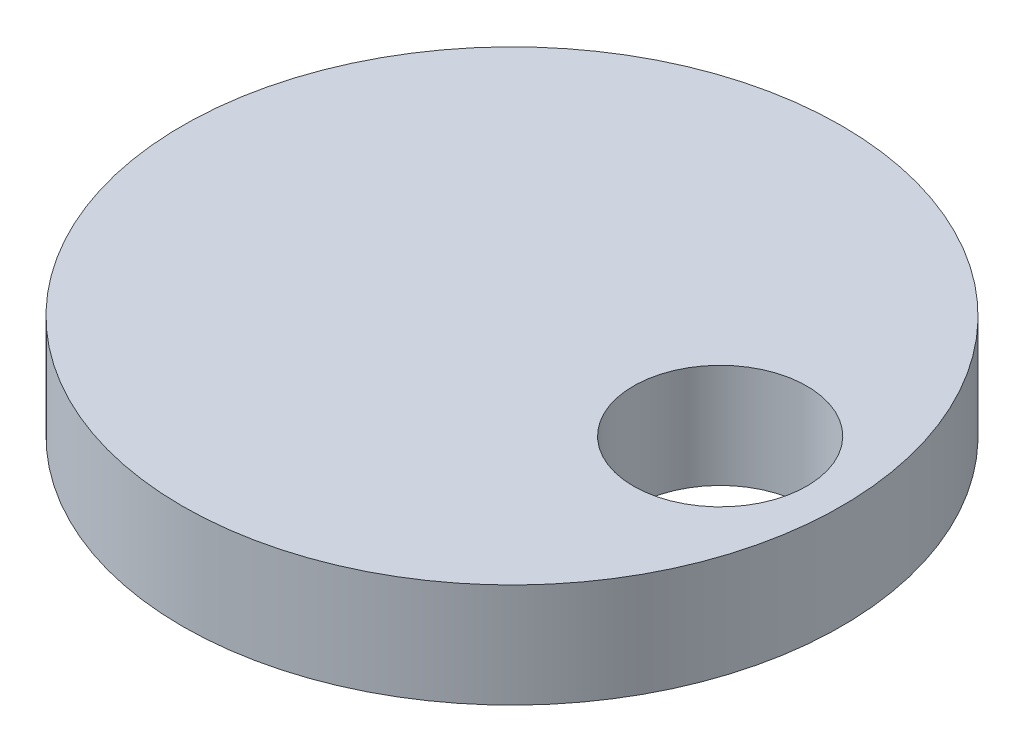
from build123d import *

# Parameters (mm, degrees)
SKETCH1_R         = 9.5
EXTRUDE1_DEPTH    = 3
M6_TAPPED_HOLE1_D = 5


with BuildPart() as part:
    # Sketch1 → Extrude1 (new body)
    with BuildSketch(Plane(origin=(0, 0, 0), x_dir=(1, 0, 0), z_dir=(0, 1, 0))):
        with Locations(Location((0, 0, 0), (0, 0, 270))):
            Circle(SKETCH1_R)
    extrude(amount=EXTRUDE1_DEPTH)

    # M6 Tapped Hole1 (through all)
    with Locations(Plane(origin=(6, 3, 0), x_dir=(0, 0, 1), z_dir=(0, 1, 0))):
        with Locations((0, 0)):
            Hole(M6_TAPPED_HOLE1_D / 2)


solid = part.part
